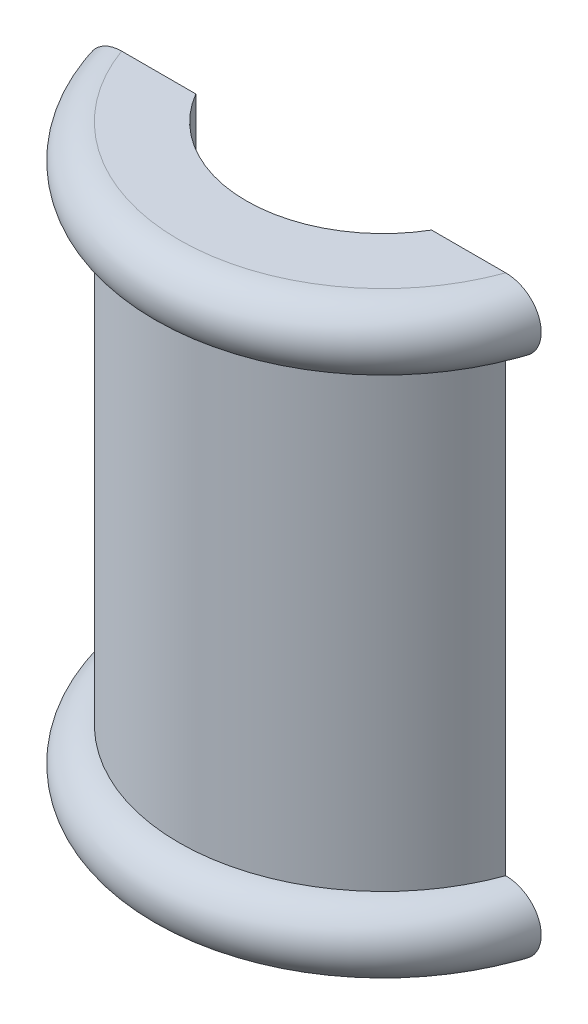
ISO-10303-21;
HEADER;
FILE_DESCRIPTION(('STEP AP214'),'2;1');
FILE_NAME('part.step','',(''),(''),'','','');
FILE_SCHEMA(('AUTOMOTIVE_DESIGN { 1 0 10303 214 1 1 1 1 }'));
ENDSEC;
DATA;
#1=APPLICATION_CONTEXT('core data for automotive mechanical design processes');
#2=APPLICATION_PROTOCOL_DEFINITION('international standard','automotive_design',2000,#1);
#3=PRODUCT_CONTEXT('',#1,'mechanical');
#4=PRODUCT('Part','Part','',(#3));
#5=PRODUCT_RELATED_PRODUCT_CATEGORY('part','',(#4));
#6=PRODUCT_DEFINITION_FORMATION('','',#4);
#7=PRODUCT_DEFINITION_CONTEXT('part definition',#1,'design');
#8=PRODUCT_DEFINITION('design','',#6,#7);
#9=PRODUCT_DEFINITION_SHAPE('','',#8);
#10=(LENGTH_UNIT() NAMED_UNIT(*) SI_UNIT(.MILLI.,.METRE.));
#11=(NAMED_UNIT(*) PLANE_ANGLE_UNIT() SI_UNIT($,.RADIAN.));
#12=(NAMED_UNIT(*) SI_UNIT($,.STERADIAN.) SOLID_ANGLE_UNIT());
#13=UNCERTAINTY_MEASURE_WITH_UNIT(LENGTH_MEASURE(1.E-05),#10,'distance_accuracy_value','');
#14=(GEOMETRIC_REPRESENTATION_CONTEXT(3) GLOBAL_UNCERTAINTY_ASSIGNED_CONTEXT((#13)) GLOBAL_UNIT_ASSIGNED_CONTEXT((#10,
#11,#12)) REPRESENTATION_CONTEXT('',''));
#15=CARTESIAN_POINT('',(0.,0.,0.));
#16=DIRECTION('',(0.,0.,1.));
#17=DIRECTION('',(1.,0.,0.));
#18=AXIS2_PLACEMENT_3D('',#15,#16,#17);
#19=CARTESIAN_POINT('',(0.,22.5,-82.125));
#20=DIRECTION('',(0.,1.,0.));
#21=DIRECTION('',(0.,0.,1.));
#22=AXIS2_PLACEMENT_3D('',#19,#20,#21);
#23=CYLINDRICAL_SURFACE('',#22,8.125);
#24=CARTESIAN_POINT('',(0.,40.,-82.125));
#25=DIRECTION('',(0.,1.,0.));
#26=DIRECTION('',(0.,0.,1.));
#27=AXIS2_PLACEMENT_3D('',#24,#25,#26);
#28=CIRCLE('',#27,8.125);
#29=CARTESIAN_POINT('',(7.,40.,-78.));
#30=VERTEX_POINT('',#29);
#31=CARTESIAN_POINT('',(-7.,40.,-78.));
#32=VERTEX_POINT('',#31);
#33=EDGE_CURVE('E81',#30,#32,#28,.F.);
#34=ORIENTED_EDGE('',*,*,#33,.F.);
#35=DIRECTION('',(0.,1.,0.));
#36=VECTOR('',#35,1.);
#37=CARTESIAN_POINT('',(7.,22.5,-78.));
#38=LINE('',#37,#36);
#39=CARTESIAN_POINT('',(7.,5.,-78.));
#40=VERTEX_POINT('',#39);
#41=EDGE_CURVE('E77',#30,#40,#38,.F.);
#42=ORIENTED_EDGE('',*,*,#41,.T.);
#43=CARTESIAN_POINT('',(0.,5.,-82.125));
#44=DIRECTION('',(0.,1.,0.));
#45=DIRECTION('',(0.,0.,1.));
#46=AXIS2_PLACEMENT_3D('',#43,#44,#45);
#47=CIRCLE('',#46,8.125);
#48=CARTESIAN_POINT('',(-7.,5.,-78.));
#49=VERTEX_POINT('',#48);
#50=EDGE_CURVE('E19',#49,#40,#47,.T.);
#51=ORIENTED_EDGE('',*,*,#50,.F.);
#52=DIRECTION('',(0.,1.,0.));
#53=VECTOR('',#52,1.);
#54=CARTESIAN_POINT('',(-7.,22.5,-78.));
#55=LINE('',#54,#53);
#56=EDGE_CURVE('E74',#49,#32,#55,.T.);
#57=ORIENTED_EDGE('',*,*,#56,.T.);
#58=EDGE_LOOP('',(#34,#42,#51,#57));
#59=FACE_BOUND('',#58,.T.);
#60=ADVANCED_FACE('F16',(#59),#23,.F.);
#61=CARTESIAN_POINT('',(10.125,5.,-82.125));
#62=DIRECTION('',(0.,-1.,0.));
#63=DIRECTION('',(0.,0.,-1.));
#64=AXIS2_PLACEMENT_3D('',#61,#62,#63);
#65=PLANE('',#64);
#66=DIRECTION('',(1.,0.,0.));
#67=VECTOR('',#66,1.);
#68=CARTESIAN_POINT('',(0.,5.,-78.));
#69=LINE('',#68,#67);
#70=CARTESIAN_POINT('',(11.4017542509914,5.,-78.));
#71=VERTEX_POINT('',#70);
#72=EDGE_CURVE('E138',#40,#71,#69,.T.);
#73=ORIENTED_EDGE('',*,*,#72,.T.);
#74=CARTESIAN_POINT('',(0.,5.,-82.125));
#75=DIRECTION('',(0.,1.,0.));
#76=DIRECTION('',(-0.940350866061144,0.,0.340206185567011));
#77=AXIS2_PLACEMENT_3D('',#74,#75,#76);
#78=CIRCLE('',#77,12.125);
#79=CARTESIAN_POINT('',(-11.4017542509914,5.,-78.));
#80=VERTEX_POINT('',#79);
#81=EDGE_CURVE('E87',#80,#71,#78,.T.);
#82=ORIENTED_EDGE('',*,*,#81,.F.);
#83=DIRECTION('',(1.,0.,0.));
#84=VECTOR('',#83,1.);
#85=CARTESIAN_POINT('',(0.,5.,-78.));
#86=LINE('',#85,#84);
#87=EDGE_CURVE('E84',#80,#49,#86,.T.);
#88=ORIENTED_EDGE('',*,*,#87,.T.);
#89=ORIENTED_EDGE('',*,*,#50,.T.);
#90=EDGE_LOOP('',(#73,#82,#88,#89));
#91=FACE_BOUND('',#90,.T.);
#92=ADVANCED_FACE('F85',(#91),#65,.T.);
#93=CARTESIAN_POINT('',(10.125,40.,-82.125));
#94=DIRECTION('',(0.,1.,0.));
#95=DIRECTION('',(0.,0.,1.));
#96=AXIS2_PLACEMENT_3D('',#93,#94,#95);
#97=PLANE('',#96);
#98=DIRECTION('',(1.,0.,0.));
#99=VECTOR('',#98,1.);
#100=CARTESIAN_POINT('',(0.,40.,-78.));
#101=LINE('',#100,#99);
#102=CARTESIAN_POINT('',(11.4017542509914,40.,-78.));
#103=VERTEX_POINT('',#102);
#104=EDGE_CURVE('E143',#103,#30,#101,.F.);
#105=ORIENTED_EDGE('',*,*,#104,.T.);
#106=ORIENTED_EDGE('',*,*,#33,.T.);
#107=DIRECTION('',(1.,0.,0.));
#108=VECTOR('',#107,1.);
#109=CARTESIAN_POINT('',(0.,40.,-78.));
#110=LINE('',#109,#108);
#111=CARTESIAN_POINT('',(-11.4017542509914,40.,-78.));
#112=VERTEX_POINT('',#111);
#113=EDGE_CURVE('E96',#32,#112,#110,.F.);
#114=ORIENTED_EDGE('',*,*,#113,.T.);
#115=CARTESIAN_POINT('',(0.,40.,-82.125));
#116=DIRECTION('',(0.,-1.,0.));
#117=DIRECTION('',(0.940350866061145,0.,0.34020618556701));
#118=AXIS2_PLACEMENT_3D('',#115,#116,#117);
#119=CIRCLE('',#118,12.125);
#120=EDGE_CURVE('E190',#103,#112,#119,.T.);
#121=ORIENTED_EDGE('',*,*,#120,.F.);
#122=EDGE_LOOP('',(#105,#106,#114,#121));
#123=FACE_BOUND('',#122,.T.);
#124=ADVANCED_FACE('F186',(#123),#97,.T.);
#125=CARTESIAN_POINT('',(0.,22.5,-78.));
#126=DIRECTION('',(0.,0.,1.));
#127=DIRECTION('',(1.,0.,0.));
#128=AXIS2_PLACEMENT_3D('',#125,#126,#127);
#129=PLANE('',#128);
#130=DIRECTION('',(0.,1.,0.));
#131=VECTOR('',#130,1.);
#132=CARTESIAN_POINT('',(-11.4017542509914,22.5,-78.));
#133=LINE('',#132,#131);
#134=CARTESIAN_POINT('',(-11.4017542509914,36.,-78.));
#135=VERTEX_POINT('',#134);
#136=CARTESIAN_POINT('',(-11.4017542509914,9.,-78.));
#137=VERTEX_POINT('',#136);
#138=EDGE_CURVE('E112',#135,#137,#133,.F.);
#139=ORIENTED_EDGE('',*,*,#138,.F.);
#140=CARTESIAN_POINT('',(-13.5092560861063,38.,-78.));
#141=CARTESIAN_POINT('',(-13.5092568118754,37.9455827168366,-78.));
#142=CARTESIAN_POINT('',(-13.506932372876,37.8911920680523,-78.));
#143=CARTESIAN_POINT('',(-13.4976667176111,37.782812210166,-78.));
#144=CARTESIAN_POINT('',(-13.4907260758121,37.7288229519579,-78.));
#145=CARTESIAN_POINT('',(-13.4630798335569,37.5682525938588,-78.));
#146=CARTESIAN_POINT('',(-13.4355494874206,37.4627672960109,-78.));
#147=CARTESIAN_POINT('',(-13.3632238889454,37.2579536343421,-78.));
#148=CARTESIAN_POINT('',(-13.318426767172,37.158625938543,-78.));
#149=CARTESIAN_POINT('',(-13.2130546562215,36.9687139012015,-78.));
#150=CARTESIAN_POINT('',(-13.1524775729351,36.8781307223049,-78.));
#151=CARTESIAN_POINT('',(-13.0163336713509,36.7065607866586,-78.));
#152=CARTESIAN_POINT('',(-12.9405330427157,36.6257599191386,-78.));
#153=CARTESIAN_POINT('',(-12.7769218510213,36.4774132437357,-78.));
#154=CARTESIAN_POINT('',(-12.6891090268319,36.4098699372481,-78.));
#155=CARTESIAN_POINT('',(-12.5001227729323,36.2869230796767,-78.));
#156=CARTESIAN_POINT('',(-12.3985457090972,36.2321408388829,-78.));
#157=CARTESIAN_POINT('',(-12.1879337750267,36.1394834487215,-78.));
#158=CARTESIAN_POINT('',(-12.0788970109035,36.1016126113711,-78.));
#159=CARTESIAN_POINT('',(-11.875285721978,36.0483242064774,-78.));
#160=CARTESIAN_POINT('',(-11.7814107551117,36.0301811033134,-78.));
#161=CARTESIAN_POINT('',(-11.5922750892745,36.0060188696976,-78.));
#162=CARTESIAN_POINT('',(-11.4970170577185,35.9999788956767,-78.));
#163=CARTESIAN_POINT('',(-11.4017542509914,36.,-78.));
#164=B_SPLINE_CURVE_WITH_KNOTS('',3,(#140,#141,#142,#143,#144,#145,#146,#147,#148,#149,#150,
#151,#152,#153,#154,#155,#156,#157,#158,#159,#160,#161,#162,#163),.UNSPECIFIED.,.F.,.F.,(4,2,2,
2,2,2,2,2,2,2,2,4),(0.,0.163149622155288,0.326278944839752,0.651644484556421,0.977045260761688,
1.30248924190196,1.6333775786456,1.96432828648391,2.30903552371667,2.65383060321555,
2.93990429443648,3.22548489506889),.UNSPECIFIED.);
#165=CARTESIAN_POINT('',(-13.5092560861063,38.,-78.));
#166=VERTEX_POINT('',#165);
#167=EDGE_CURVE('E113',#166,#135,#164,.T.);
#168=ORIENTED_EDGE('',*,*,#167,.F.);
#169=CARTESIAN_POINT('',(-11.4017542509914,40.,-78.));
#170=CARTESIAN_POINT('',(-11.4637206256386,39.999994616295,-78.));
#171=CARTESIAN_POINT('',(-11.5256488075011,39.9974508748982,-78.));
#172=CARTESIAN_POINT('',(-11.6490884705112,39.9872590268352,-78.));
#173=CARTESIAN_POINT('',(-11.710599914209,39.9796104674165,-78.));
#174=CARTESIAN_POINT('',(-11.894039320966,39.9489571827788,-78.));
#175=CARTESIAN_POINT('',(-12.0148136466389,39.9182448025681,-78.));
#176=CARTESIAN_POINT('',(-12.1906665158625,39.8571583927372,-78.));
#177=CARTESIAN_POINT('',(-12.248469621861,39.8342544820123,-78.));
#178=CARTESIAN_POINT('',(-12.3618849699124,39.7835311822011,-78.));
#179=CARTESIAN_POINT('',(-12.4174977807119,39.7557130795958,-78.));
#180=CARTESIAN_POINT('',(-12.5259988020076,39.6953420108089,-78.));
#181=CARTESIAN_POINT('',(-12.5788904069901,39.6627951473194,-78.));
#182=CARTESIAN_POINT('',(-12.6816258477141,39.593105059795,-78.));
#183=CARTESIAN_POINT('',(-12.7314661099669,39.5559565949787,-78.));
#184=CARTESIAN_POINT('',(-12.8720373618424,39.4409418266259,-78.));
#185=CARTESIAN_POINT('',(-12.9580357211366,39.3571486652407,-78.));
#186=CARTESIAN_POINT('',(-13.1137787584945,39.1756318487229,-78.));
#187=CARTESIAN_POINT('',(-13.1835314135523,39.0779150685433,-78.));
#188=CARTESIAN_POINT('',(-13.2724942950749,38.9257728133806,-78.));
#189=CARTESIAN_POINT('',(-13.2990284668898,38.8755140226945,-78.));
#190=CARTESIAN_POINT('',(-13.3476070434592,38.7729052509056,-78.));
#191=CARTESIAN_POINT('',(-13.3696552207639,38.7205570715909,-78.));
#192=CARTESIAN_POINT('',(-13.4090584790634,38.6141718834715,-78.));
#193=CARTESIAN_POINT('',(-13.4264171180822,38.560136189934,-78.));
#194=CARTESIAN_POINT('',(-13.4563028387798,38.4507536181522,-78.));
#195=CARTESIAN_POINT('',(-13.468830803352,38.395406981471,-78.));
#196=CARTESIAN_POINT('',(-13.4889825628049,38.2835689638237,-78.));
#197=CARTESIAN_POINT('',(-13.4965839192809,38.2270735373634,-78.));
#198=CARTESIAN_POINT('',(-13.5067211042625,38.1137189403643,-78.));
#199=CARTESIAN_POINT('',(-13.5092647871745,38.0568604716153,-78.));
#200=CARTESIAN_POINT('',(-13.5092560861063,38.,-78.));
#201=B_SPLINE_CURVE_WITH_KNOTS('',3,(#169,#170,#171,#172,#173,#174,#175,#176,#177,#178,#179,
#180,#181,#182,#183,#184,#185,#186,#187,#188,#189,#190,#191,#192,#193,#194,#195,#196,#197,#198,
#199,#200),.UNSPECIFIED.,.F.,.F.,(4,2,2,2,2,2,2,2,2,2,2,2,2,2,2,4),(0.,0.185769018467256,
0.371554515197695,0.743299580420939,0.929647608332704,1.11594692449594,1.30200791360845,
1.48828279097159,1.84654186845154,2.20462466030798,2.37494708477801,2.54512567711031,
2.71517478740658,2.88519280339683,3.05597982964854,3.22650142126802),.UNSPECIFIED.);
#202=EDGE_CURVE('E211',#112,#166,#201,.T.);
#203=ORIENTED_EDGE('',*,*,#202,.F.);
#204=ORIENTED_EDGE('',*,*,#113,.F.);
#205=ORIENTED_EDGE('',*,*,#56,.F.);
#206=ORIENTED_EDGE('',*,*,#87,.F.);
#207=CARTESIAN_POINT('',(-13.5092560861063,7.,-78.));
#208=CARTESIAN_POINT('',(-13.5092568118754,6.94558271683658,-78.));
#209=CARTESIAN_POINT('',(-13.506932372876,6.89119206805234,-78.));
#210=CARTESIAN_POINT('',(-13.4976667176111,6.78281221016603,-78.));
#211=CARTESIAN_POINT('',(-13.4907260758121,6.72882295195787,-78.));
#212=CARTESIAN_POINT('',(-13.4630798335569,6.56825259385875,-78.));
#213=CARTESIAN_POINT('',(-13.4355494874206,6.46276729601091,-78.));
#214=CARTESIAN_POINT('',(-13.3632238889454,6.25795363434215,-78.));
#215=CARTESIAN_POINT('',(-13.318426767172,6.15862593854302,-78.));
#216=CARTESIAN_POINT('',(-13.2130546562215,5.96871390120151,-78.));
#217=CARTESIAN_POINT('',(-13.1524775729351,5.87813072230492,-78.));
#218=CARTESIAN_POINT('',(-13.0163336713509,5.7065607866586,-78.));
#219=CARTESIAN_POINT('',(-12.9405330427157,5.62575991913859,-78.));
#220=CARTESIAN_POINT('',(-12.7769218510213,5.47741324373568,-78.));
#221=CARTESIAN_POINT('',(-12.6891090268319,5.40986993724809,-78.));
#222=CARTESIAN_POINT('',(-12.5001227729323,5.28692307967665,-78.));
#223=CARTESIAN_POINT('',(-12.3985457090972,5.2321408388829,-78.));
#224=CARTESIAN_POINT('',(-12.1879337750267,5.13948344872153,-78.));
#225=CARTESIAN_POINT('',(-12.0788970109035,5.10161261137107,-78.));
#226=CARTESIAN_POINT('',(-11.875285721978,5.04832420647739,-78.));
#227=CARTESIAN_POINT('',(-11.7814107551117,5.03018110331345,-78.));
#228=CARTESIAN_POINT('',(-11.5922750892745,5.00601886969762,-78.));
#229=CARTESIAN_POINT('',(-11.4970170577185,4.99997889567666,-78.));
#230=CARTESIAN_POINT('',(-11.4017542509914,5.,-78.));
#231=B_SPLINE_CURVE_WITH_KNOTS('',3,(#207,#208,#209,#210,#211,#212,#213,#214,#215,#216,#217,
#218,#219,#220,#221,#222,#223,#224,#225,#226,#227,#228,#229,#230),.UNSPECIFIED.,.F.,.F.,(4,2,2,
2,2,2,2,2,2,2,2,4),(0.,0.163149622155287,0.326278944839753,0.651644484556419,0.977045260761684,
1.30248924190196,1.6333775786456,1.96432828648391,2.30903552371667,2.65383060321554,
2.93990429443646,3.22548489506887),.UNSPECIFIED.);
#232=CARTESIAN_POINT('',(-13.5092560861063,7.,-78.));
#233=VERTEX_POINT('',#232);
#234=EDGE_CURVE('E180',#233,#80,#231,.T.);
#235=ORIENTED_EDGE('',*,*,#234,.F.);
#236=CARTESIAN_POINT('',(-11.4017542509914,9.,-78.));
#237=CARTESIAN_POINT('',(-11.4637206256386,8.999994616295,-78.));
#238=CARTESIAN_POINT('',(-11.525648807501,8.99745087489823,-78.));
#239=CARTESIAN_POINT('',(-11.6490884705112,8.98725902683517,-78.));
#240=CARTESIAN_POINT('',(-11.710599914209,8.97961046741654,-78.));
#241=CARTESIAN_POINT('',(-11.894039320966,8.94895718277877,-78.));
#242=CARTESIAN_POINT('',(-12.0148136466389,8.91824480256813,-78.));
#243=CARTESIAN_POINT('',(-12.1906665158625,8.85715839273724,-78.));
#244=CARTESIAN_POINT('',(-12.248469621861,8.83425448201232,-78.));
#245=CARTESIAN_POINT('',(-12.3618849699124,8.78353118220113,-78.));
#246=CARTESIAN_POINT('',(-12.4174977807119,8.75571307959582,-78.));
#247=CARTESIAN_POINT('',(-12.5259988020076,8.69534201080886,-78.));
#248=CARTESIAN_POINT('',(-12.5788904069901,8.6627951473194,-78.));
#249=CARTESIAN_POINT('',(-12.6816258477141,8.59310505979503,-78.));
#250=CARTESIAN_POINT('',(-12.7314661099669,8.55595659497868,-78.));
#251=CARTESIAN_POINT('',(-12.8720373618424,8.44094182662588,-78.));
#252=CARTESIAN_POINT('',(-12.9580357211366,8.35714866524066,-78.));
#253=CARTESIAN_POINT('',(-13.1137787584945,8.17563184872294,-78.));
#254=CARTESIAN_POINT('',(-13.1835314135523,8.07791506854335,-78.));
#255=CARTESIAN_POINT('',(-13.2724942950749,7.92577281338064,-78.));
#256=CARTESIAN_POINT('',(-13.2990284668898,7.87551402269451,-78.));
#257=CARTESIAN_POINT('',(-13.3476070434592,7.77290525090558,-78.));
#258=CARTESIAN_POINT('',(-13.3696552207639,7.72055707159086,-78.));
#259=CARTESIAN_POINT('',(-13.4090584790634,7.61417188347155,-78.));
#260=CARTESIAN_POINT('',(-13.4264171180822,7.56013618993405,-78.));
#261=CARTESIAN_POINT('',(-13.4563028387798,7.45075361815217,-78.));
#262=CARTESIAN_POINT('',(-13.468830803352,7.39540698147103,-78.));
#263=CARTESIAN_POINT('',(-13.4889825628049,7.28356896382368,-78.));
#264=CARTESIAN_POINT('',(-13.4965839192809,7.22707353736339,-78.));
#265=CARTESIAN_POINT('',(-13.5067211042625,7.11371894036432,-78.));
#266=CARTESIAN_POINT('',(-13.5092647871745,7.05686047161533,-78.));
#267=CARTESIAN_POINT('',(-13.5092560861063,7.,-78.));
#268=B_SPLINE_CURVE_WITH_KNOTS('',3,(#236,#237,#238,#239,#240,#241,#242,#243,#244,#245,#246,
#247,#248,#249,#250,#251,#252,#253,#254,#255,#256,#257,#258,#259,#260,#261,#262,#263,#264,#265,
#266,#267),.UNSPECIFIED.,.F.,.F.,(4,2,2,2,2,2,2,2,2,2,2,2,2,2,2,4),(0.,0.185769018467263,
0.371554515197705,0.743299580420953,0.929647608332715,1.11594692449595,1.30200791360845,
1.4882827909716,1.84654186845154,2.20462466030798,2.37494708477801,2.54512567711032,
2.71517478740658,2.88519280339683,3.05597982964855,3.22650142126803),.UNSPECIFIED.);
#269=EDGE_CURVE('E98',#137,#233,#268,.T.);
#270=ORIENTED_EDGE('',*,*,#269,.F.);
#271=EDGE_LOOP('',(#139,#168,#203,#204,#205,#206,#235,#270));
#272=FACE_BOUND('',#271,.T.);
#273=ADVANCED_FACE('F93',(#272),#129,.F.);
#274=CARTESIAN_POINT('',(0.,7.,-82.125));
#275=DIRECTION('',(0.,-1.,0.));
#276=DIRECTION('',(0.,0.,-1.));
#277=AXIS2_PLACEMENT_3D('',#274,#275,#276);
#278=TOROIDAL_SURFACE('',#277,12.125,2.);
#279=ORIENTED_EDGE('',*,*,#81,.T.);
#280=CARTESIAN_POINT('',(11.4017542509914,5.,-78.));
#281=CARTESIAN_POINT('',(11.4637206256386,5.00000538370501,-78.));
#282=CARTESIAN_POINT('',(11.5256488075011,5.00254912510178,-78.));
#283=CARTESIAN_POINT('',(11.6490884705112,5.01274097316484,-78.));
#284=CARTESIAN_POINT('',(11.710599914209,5.02038953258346,-78.));
#285=CARTESIAN_POINT('',(11.894039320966,5.05104281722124,-78.));
#286=CARTESIAN_POINT('',(12.0148136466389,5.08175519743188,-78.));
#287=CARTESIAN_POINT('',(12.1906665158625,5.14284160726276,-78.));
#288=CARTESIAN_POINT('',(12.248469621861,5.16574551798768,-78.));
#289=CARTESIAN_POINT('',(12.3618849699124,5.21646881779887,-78.));
#290=CARTESIAN_POINT('',(12.4174977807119,5.24428692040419,-78.));
#291=CARTESIAN_POINT('',(12.5259988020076,5.30465798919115,-78.));
#292=CARTESIAN_POINT('',(12.5788904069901,5.33720485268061,-78.));
#293=CARTESIAN_POINT('',(12.6816258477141,5.40689494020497,-78.));
#294=CARTESIAN_POINT('',(12.7314661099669,5.44404340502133,-78.));
#295=CARTESIAN_POINT('',(12.8720373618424,5.55905817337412,-78.));
#296=CARTESIAN_POINT('',(12.9580357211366,5.64285133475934,-78.));
#297=CARTESIAN_POINT('',(13.1137787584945,5.82436815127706,-78.));
#298=CARTESIAN_POINT('',(13.1835314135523,5.92208493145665,-78.));
#299=CARTESIAN_POINT('',(13.2724942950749,6.07422718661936,-78.));
#300=CARTESIAN_POINT('',(13.2990284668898,6.12448597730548,-78.));
#301=CARTESIAN_POINT('',(13.3476070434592,6.22709474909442,-78.));
#302=CARTESIAN_POINT('',(13.3696552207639,6.27944292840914,-78.));
#303=CARTESIAN_POINT('',(13.4090584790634,6.38582811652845,-78.));
#304=CARTESIAN_POINT('',(13.4264171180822,6.43986381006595,-78.));
#305=CARTESIAN_POINT('',(13.4563028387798,6.54924638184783,-78.));
#306=CARTESIAN_POINT('',(13.468830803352,6.60459301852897,-78.));
#307=CARTESIAN_POINT('',(13.4889825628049,6.71643103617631,-78.));
#308=CARTESIAN_POINT('',(13.4965839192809,6.77292646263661,-78.));
#309=CARTESIAN_POINT('',(13.5067211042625,6.88628105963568,-78.));
#310=CARTESIAN_POINT('',(13.5092647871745,6.94313952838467,-78.));
#311=CARTESIAN_POINT('',(13.5092560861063,7.,-78.));
#312=B_SPLINE_CURVE_WITH_KNOTS('',3,(#280,#281,#282,#283,#284,#285,#286,#287,#288,#289,#290,
#291,#292,#293,#294,#295,#296,#297,#298,#299,#300,#301,#302,#303,#304,#305,#306,#307,#308,#309,
#310,#311),.UNSPECIFIED.,.F.,.F.,(4,2,2,2,2,2,2,2,2,2,2,2,2,2,2,4),(0.,0.185769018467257,
0.371554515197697,0.743299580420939,0.9296476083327,1.11594692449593,1.30200791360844,
1.48828279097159,1.84654186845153,2.20462466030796,2.37494708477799,2.5451256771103,
2.71517478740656,2.88519280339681,3.05597982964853,3.22650142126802),.UNSPECIFIED.);
#313=CARTESIAN_POINT('',(13.5092560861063,7.,-78.));
#314=VERTEX_POINT('',#313);
#315=EDGE_CURVE('E140',#71,#314,#312,.T.);
#316=ORIENTED_EDGE('',*,*,#315,.T.);
#317=CARTESIAN_POINT('',(13.5092560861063,7.,-78.));
#318=CARTESIAN_POINT('',(13.5092568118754,7.05441728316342,-78.));
#319=CARTESIAN_POINT('',(13.506932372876,7.10880793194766,-78.));
#320=CARTESIAN_POINT('',(13.4976667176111,7.21718778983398,-78.));
#321=CARTESIAN_POINT('',(13.4907260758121,7.27117704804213,-78.));
#322=CARTESIAN_POINT('',(13.4630798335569,7.43174740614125,-78.));
#323=CARTESIAN_POINT('',(13.4355494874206,7.53723270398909,-78.));
#324=CARTESIAN_POINT('',(13.3632238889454,7.74204636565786,-78.));
#325=CARTESIAN_POINT('',(13.318426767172,7.84137406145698,-78.));
#326=CARTESIAN_POINT('',(13.2130546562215,8.0312860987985,-78.));
#327=CARTESIAN_POINT('',(13.1524775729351,8.12186927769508,-78.));
#328=CARTESIAN_POINT('',(13.0163336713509,8.29343921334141,-78.));
#329=CARTESIAN_POINT('',(12.9405330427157,8.37424008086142,-78.));
#330=CARTESIAN_POINT('',(12.7769218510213,8.52258675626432,-78.));
#331=CARTESIAN_POINT('',(12.6891090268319,8.59013006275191,-78.));
#332=CARTESIAN_POINT('',(12.5001227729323,8.71307692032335,-78.));
#333=CARTESIAN_POINT('',(12.3985457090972,8.76785916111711,-78.));
#334=CARTESIAN_POINT('',(12.1879337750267,8.86051655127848,-78.));
#335=CARTESIAN_POINT('',(12.0788970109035,8.89838738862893,-78.));
#336=CARTESIAN_POINT('',(11.875285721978,8.95167579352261,-78.));
#337=CARTESIAN_POINT('',(11.7814107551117,8.96981889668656,-78.));
#338=CARTESIAN_POINT('',(11.5922750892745,8.99398113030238,-78.));
#339=CARTESIAN_POINT('',(11.4970170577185,9.00002110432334,-78.));
#340=CARTESIAN_POINT('',(11.4017542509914,9.,-78.));
#341=B_SPLINE_CURVE_WITH_KNOTS('',3,(#317,#318,#319,#320,#321,#322,#323,#324,#325,#326,#327,
#328,#329,#330,#331,#332,#333,#334,#335,#336,#337,#338,#339,#340),.UNSPECIFIED.,.F.,.F.,(4,2,2,
2,2,2,2,2,2,2,2,4),(0.,0.163149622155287,0.326278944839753,0.651644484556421,0.977045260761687,
1.30248924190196,1.6333775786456,1.96432828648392,2.30903552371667,2.65383060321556,
2.93990429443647,3.22548489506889),.UNSPECIFIED.);
#342=CARTESIAN_POINT('',(11.4017542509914,9.,-78.));
#343=VERTEX_POINT('',#342);
#344=EDGE_CURVE('E146',#314,#343,#341,.T.);
#345=ORIENTED_EDGE('',*,*,#344,.T.);
#346=CARTESIAN_POINT('',(0.,9.,-82.125));
#347=DIRECTION('',(0.,1.,0.));
#348=DIRECTION('',(0.,0.,1.));
#349=AXIS2_PLACEMENT_3D('',#346,#347,#348);
#350=CIRCLE('',#349,12.125);
#351=EDGE_CURVE('E134',#137,#343,#350,.T.);
#352=ORIENTED_EDGE('',*,*,#351,.F.);
#353=ORIENTED_EDGE('',*,*,#269,.T.);
#354=ORIENTED_EDGE('',*,*,#234,.T.);
#355=EDGE_LOOP('',(#279,#316,#345,#352,#353,#354));
#356=FACE_BOUND('',#355,.T.);
#357=ADVANCED_FACE('F153',(#356),#278,.T.);
#358=CARTESIAN_POINT('',(0.,22.5,-78.));
#359=DIRECTION('',(0.,0.,1.));
#360=DIRECTION('',(1.,0.,0.));
#361=AXIS2_PLACEMENT_3D('',#358,#359,#360);
#362=PLANE('',#361);
#363=ORIENTED_EDGE('',*,*,#72,.F.);
#364=ORIENTED_EDGE('',*,*,#41,.F.);
#365=ORIENTED_EDGE('',*,*,#104,.F.);
#366=CARTESIAN_POINT('',(13.5092560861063,38.,-78.));
#367=CARTESIAN_POINT('',(13.5092568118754,38.0544172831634,-78.));
#368=CARTESIAN_POINT('',(13.506932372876,38.1088079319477,-78.));
#369=CARTESIAN_POINT('',(13.4976667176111,38.217187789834,-78.));
#370=CARTESIAN_POINT('',(13.4907260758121,38.2711770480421,-78.));
#371=CARTESIAN_POINT('',(13.4630798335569,38.4317474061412,-78.));
#372=CARTESIAN_POINT('',(13.4355494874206,38.5372327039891,-78.));
#373=CARTESIAN_POINT('',(13.3632238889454,38.7420463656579,-78.));
#374=CARTESIAN_POINT('',(13.318426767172,38.841374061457,-78.));
#375=CARTESIAN_POINT('',(13.2130546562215,39.0312860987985,-78.));
#376=CARTESIAN_POINT('',(13.1524775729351,39.1218692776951,-78.));
#377=CARTESIAN_POINT('',(13.0163336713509,39.2934392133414,-78.));
#378=CARTESIAN_POINT('',(12.9405330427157,39.3742400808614,-78.));
#379=CARTESIAN_POINT('',(12.7769218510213,39.5225867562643,-78.));
#380=CARTESIAN_POINT('',(12.6891090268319,39.5901300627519,-78.));
#381=CARTESIAN_POINT('',(12.5001227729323,39.7130769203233,-78.));
#382=CARTESIAN_POINT('',(12.3985457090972,39.7678591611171,-78.));
#383=CARTESIAN_POINT('',(12.1879337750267,39.8605165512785,-78.));
#384=CARTESIAN_POINT('',(12.0788970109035,39.8983873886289,-78.));
#385=CARTESIAN_POINT('',(11.8752857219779,39.9516757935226,-78.));
#386=CARTESIAN_POINT('',(11.7814107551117,39.9698188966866,-78.));
#387=CARTESIAN_POINT('',(11.5922750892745,39.9939811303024,-78.));
#388=CARTESIAN_POINT('',(11.4970170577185,40.0000211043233,-78.));
#389=CARTESIAN_POINT('',(11.4017542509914,40.,-78.));
#390=B_SPLINE_CURVE_WITH_KNOTS('',3,(#366,#367,#368,#369,#370,#371,#372,#373,#374,#375,#376,
#377,#378,#379,#380,#381,#382,#383,#384,#385,#386,#387,#388,#389),.UNSPECIFIED.,.F.,.F.,(4,2,2,
2,2,2,2,2,2,2,2,4),(0.,0.163149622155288,0.326278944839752,0.651644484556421,0.97704526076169,
1.30248924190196,1.6333775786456,1.96432828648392,2.30903552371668,2.65383060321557,
2.93990429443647,3.22548489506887),.UNSPECIFIED.);
#391=CARTESIAN_POINT('',(13.5092560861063,38.,-78.));
#392=VERTEX_POINT('',#391);
#393=EDGE_CURVE('E200',#392,#103,#390,.T.);
#394=ORIENTED_EDGE('',*,*,#393,.F.);
#395=CARTESIAN_POINT('',(11.4017542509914,36.,-78.));
#396=CARTESIAN_POINT('',(11.4637206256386,36.000005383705,-78.));
#397=CARTESIAN_POINT('',(11.525648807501,36.0025491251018,-78.));
#398=CARTESIAN_POINT('',(11.6490884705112,36.0127409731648,-78.));
#399=CARTESIAN_POINT('',(11.710599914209,36.0203895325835,-78.));
#400=CARTESIAN_POINT('',(11.894039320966,36.0510428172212,-78.));
#401=CARTESIAN_POINT('',(12.0148136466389,36.0817551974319,-78.));
#402=CARTESIAN_POINT('',(12.1906665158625,36.1428416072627,-78.));
#403=CARTESIAN_POINT('',(12.248469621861,36.1657455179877,-78.));
#404=CARTESIAN_POINT('',(12.3618849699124,36.2164688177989,-78.));
#405=CARTESIAN_POINT('',(12.4174977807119,36.2442869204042,-78.));
#406=CARTESIAN_POINT('',(12.5259988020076,36.3046579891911,-78.));
#407=CARTESIAN_POINT('',(12.57889040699,36.3372048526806,-78.));
#408=CARTESIAN_POINT('',(12.6816258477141,36.4068949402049,-78.));
#409=CARTESIAN_POINT('',(12.7314661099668,36.4440434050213,-78.));
#410=CARTESIAN_POINT('',(12.8720373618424,36.5590581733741,-78.));
#411=CARTESIAN_POINT('',(12.9580357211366,36.6428513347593,-78.));
#412=CARTESIAN_POINT('',(13.1137787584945,36.824368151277,-78.));
#413=CARTESIAN_POINT('',(13.1835314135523,36.9220849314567,-78.));
#414=CARTESIAN_POINT('',(13.2724942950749,37.0742271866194,-78.));
#415=CARTESIAN_POINT('',(13.2990284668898,37.1244859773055,-78.));
#416=CARTESIAN_POINT('',(13.3476070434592,37.2270947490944,-78.));
#417=CARTESIAN_POINT('',(13.3696552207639,37.2794429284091,-78.));
#418=CARTESIAN_POINT('',(13.4090584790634,37.3858281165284,-78.));
#419=CARTESIAN_POINT('',(13.4264171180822,37.4398638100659,-78.));
#420=CARTESIAN_POINT('',(13.4563028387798,37.5492463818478,-78.));
#421=CARTESIAN_POINT('',(13.468830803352,37.604593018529,-78.));
#422=CARTESIAN_POINT('',(13.4889825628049,37.7164310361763,-78.));
#423=CARTESIAN_POINT('',(13.4965839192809,37.7729264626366,-78.));
#424=CARTESIAN_POINT('',(13.5067211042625,37.8862810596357,-78.));
#425=CARTESIAN_POINT('',(13.5092647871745,37.9431395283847,-78.));
#426=CARTESIAN_POINT('',(13.5092560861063,38.,-78.));
#427=B_SPLINE_CURVE_WITH_KNOTS('',3,(#395,#396,#397,#398,#399,#400,#401,#402,#403,#404,#405,
#406,#407,#408,#409,#410,#411,#412,#413,#414,#415,#416,#417,#418,#419,#420,#421,#422,#423,#424,
#425,#426),.UNSPECIFIED.,.F.,.F.,(4,2,2,2,2,2,2,2,2,2,2,2,2,2,2,4),(0.,0.185769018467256,
0.371554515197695,0.743299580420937,0.929647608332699,1.11594692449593,1.30200791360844,
1.48828279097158,1.84654186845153,2.20462466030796,2.374947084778,2.54512567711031,
2.71517478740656,2.88519280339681,3.05597982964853,3.22650142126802),.UNSPECIFIED.);
#428=CARTESIAN_POINT('',(11.4017542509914,36.,-78.));
#429=VERTEX_POINT('',#428);
#430=EDGE_CURVE('E34',#429,#392,#427,.T.);
#431=ORIENTED_EDGE('',*,*,#430,.F.);
#432=DIRECTION('',(0.,1.,0.));
#433=VECTOR('',#432,1.);
#434=CARTESIAN_POINT('',(11.4017542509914,22.5,-78.));
#435=LINE('',#434,#433);
#436=EDGE_CURVE('E25',#343,#429,#435,.T.);
#437=ORIENTED_EDGE('',*,*,#436,.F.);
#438=ORIENTED_EDGE('',*,*,#344,.F.);
#439=ORIENTED_EDGE('',*,*,#315,.F.);
#440=EDGE_LOOP('',(#363,#364,#365,#394,#431,#437,#438,#439));
#441=FACE_BOUND('',#440,.T.);
#442=ADVANCED_FACE('F119',(#441),#362,.F.);
#443=CARTESIAN_POINT('',(0.,38.,-82.125));
#444=DIRECTION('',(0.,-1.,0.));
#445=DIRECTION('',(0.,0.,-1.));
#446=AXIS2_PLACEMENT_3D('',#443,#444,#445);
#447=TOROIDAL_SURFACE('',#446,12.125,2.);
#448=CARTESIAN_POINT('',(0.,36.,-82.125));
#449=DIRECTION('',(0.,1.,0.));
#450=DIRECTION('',(0.,0.,1.));
#451=AXIS2_PLACEMENT_3D('',#448,#449,#450);
#452=CIRCLE('',#451,12.125);
#453=EDGE_CURVE('E11',#429,#135,#452,.F.);
#454=ORIENTED_EDGE('',*,*,#453,.F.);
#455=ORIENTED_EDGE('',*,*,#430,.T.);
#456=ORIENTED_EDGE('',*,*,#393,.T.);
#457=ORIENTED_EDGE('',*,*,#120,.T.);
#458=ORIENTED_EDGE('',*,*,#202,.T.);
#459=ORIENTED_EDGE('',*,*,#167,.T.);
#460=EDGE_LOOP('',(#454,#455,#456,#457,#458,#459));
#461=FACE_BOUND('',#460,.T.);
#462=ADVANCED_FACE('F121',(#461),#447,.T.);
#463=CARTESIAN_POINT('',(0.,22.5,-82.125));
#464=DIRECTION('',(0.,1.,0.));
#465=DIRECTION('',(0.,0.,1.));
#466=AXIS2_PLACEMENT_3D('',#463,#464,#465);
#467=CYLINDRICAL_SURFACE('',#466,12.125);
#468=ORIENTED_EDGE('',*,*,#436,.T.);
#469=ORIENTED_EDGE('',*,*,#453,.T.);
#470=ORIENTED_EDGE('',*,*,#138,.T.);
#471=ORIENTED_EDGE('',*,*,#351,.T.);
#472=EDGE_LOOP('',(#468,#469,#470,#471));
#473=FACE_BOUND('',#472,.T.);
#474=ADVANCED_FACE('F126',(#473),#467,.T.);
#475=CLOSED_SHELL('',(#60,#92,#124,#273,#357,#442,#462,#474));
#476=MANIFOLD_SOLID_BREP('B1',#475);
#477=ADVANCED_BREP_SHAPE_REPRESENTATION('',(#18,#476),#14);
#478=SHAPE_DEFINITION_REPRESENTATION(#9,#477);
ENDSEC;
END-ISO-10303-21;
